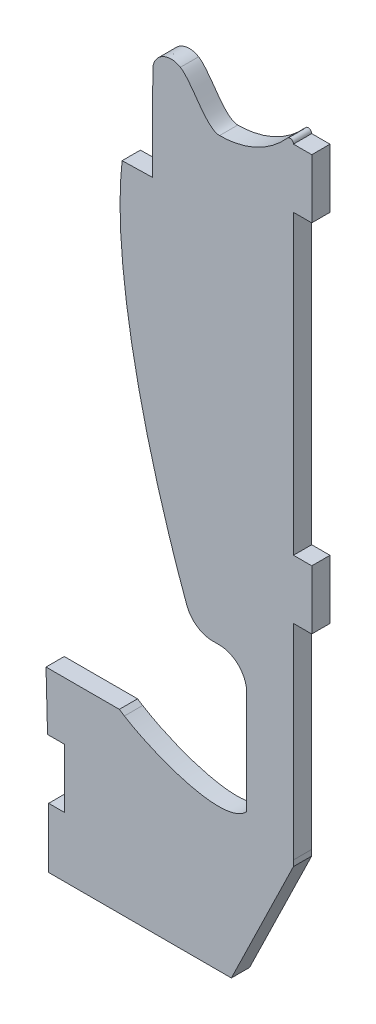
ISO-10303-21;
HEADER;
FILE_DESCRIPTION(('STEP AP214'),'2;1');
FILE_NAME('part.step','',(''),(''),'','','');
FILE_SCHEMA(('AUTOMOTIVE_DESIGN { 1 0 10303 214 1 1 1 1 }'));
ENDSEC;
DATA;
#1=APPLICATION_CONTEXT('core data for automotive mechanical design processes');
#2=APPLICATION_PROTOCOL_DEFINITION('international standard','automotive_design',2000,#1);
#3=PRODUCT_CONTEXT('',#1,'mechanical');
#4=PRODUCT('Part','Part','',(#3));
#5=PRODUCT_RELATED_PRODUCT_CATEGORY('part','',(#4));
#6=PRODUCT_DEFINITION_FORMATION('','',#4);
#7=PRODUCT_DEFINITION_CONTEXT('part definition',#1,'design');
#8=PRODUCT_DEFINITION('design','',#6,#7);
#9=PRODUCT_DEFINITION_SHAPE('','',#8);
#10=(LENGTH_UNIT() NAMED_UNIT(*) SI_UNIT(.MILLI.,.METRE.));
#11=(NAMED_UNIT(*) PLANE_ANGLE_UNIT() SI_UNIT($,.RADIAN.));
#12=(NAMED_UNIT(*) SI_UNIT($,.STERADIAN.) SOLID_ANGLE_UNIT());
#13=UNCERTAINTY_MEASURE_WITH_UNIT(LENGTH_MEASURE(1.E-05),#10,'distance_accuracy_value','');
#14=(GEOMETRIC_REPRESENTATION_CONTEXT(3) GLOBAL_UNCERTAINTY_ASSIGNED_CONTEXT((#13)) GLOBAL_UNIT_ASSIGNED_CONTEXT((#10,
#11,#12)) REPRESENTATION_CONTEXT('',''));
#15=CARTESIAN_POINT('',(0.,0.,0.));
#16=DIRECTION('',(0.,0.,1.));
#17=DIRECTION('',(1.,0.,0.));
#18=AXIS2_PLACEMENT_3D('',#15,#16,#17);
#19=CARTESIAN_POINT('',(669.415307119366,283.479999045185,3.));
#20=DIRECTION('',(0.,1.,0.));
#21=DIRECTION('',(0.,0.,1.));
#22=AXIS2_PLACEMENT_3D('',#19,#20,#21);
#23=PLANE('',#22);
#24=DIRECTION('',(1.,0.,0.));
#25=VECTOR('',#24,1.);
#26=CARTESIAN_POINT('',(669.415307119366,283.479999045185,0.));
#27=LINE('',#26,#25);
#28=CARTESIAN_POINT('',(666.406102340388,283.479999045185,0.));
#29=VERTEX_POINT('',#28);
#30=CARTESIAN_POINT('',(669.415307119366,283.479999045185,0.));
#31=VERTEX_POINT('',#30);
#32=EDGE_CURVE('E11',#29,#31,#27,.T.);
#33=ORIENTED_EDGE('',*,*,#32,.T.);
#34=DIRECTION('',(0.,0.,-1.));
#35=VECTOR('',#34,1.);
#36=CARTESIAN_POINT('',(669.415307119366,283.479999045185,3.));
#37=LINE('',#36,#35);
#38=CARTESIAN_POINT('',(669.415307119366,283.479999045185,3.));
#39=VERTEX_POINT('',#38);
#40=EDGE_CURVE('E277',#39,#31,#37,.T.);
#41=ORIENTED_EDGE('',*,*,#40,.F.);
#42=DIRECTION('',(1.,0.,0.));
#43=VECTOR('',#42,1.);
#44=CARTESIAN_POINT('',(669.415307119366,283.479999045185,3.));
#45=LINE('',#44,#43);
#46=CARTESIAN_POINT('',(666.406102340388,283.479999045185,3.));
#47=VERTEX_POINT('',#46);
#48=EDGE_CURVE('E166',#47,#39,#45,.T.);
#49=ORIENTED_EDGE('',*,*,#48,.F.);
#50=DIRECTION('',(0.,0.,-1.));
#51=VECTOR('',#50,1.);
#52=CARTESIAN_POINT('',(666.406102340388,283.479999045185,3.));
#53=LINE('',#52,#51);
#54=EDGE_CURVE('E726',#47,#29,#53,.T.);
#55=ORIENTED_EDGE('',*,*,#54,.T.);
#56=EDGE_LOOP('',(#33,#41,#49,#55));
#57=FACE_BOUND('',#56,.T.);
#58=ADVANCED_FACE('F44',(#57),#23,.F.);
#59=CARTESIAN_POINT('',(669.415307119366,293.199044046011,3.));
#60=DIRECTION('',(-1.,0.,0.));
#61=DIRECTION('',(0.,0.,1.));
#62=AXIS2_PLACEMENT_3D('',#59,#60,#61);
#63=PLANE('',#62);
#64=DIRECTION('',(0.,1.,0.));
#65=VECTOR('',#64,1.);
#66=CARTESIAN_POINT('',(669.415307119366,293.199044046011,0.));
#67=LINE('',#66,#65);
#68=CARTESIAN_POINT('',(669.415307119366,293.199044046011,0.));
#69=VERTEX_POINT('',#68);
#70=EDGE_CURVE('E57',#31,#69,#67,.T.);
#71=ORIENTED_EDGE('',*,*,#70,.T.);
#72=DIRECTION('',(0.,0.,-1.));
#73=VECTOR('',#72,1.);
#74=CARTESIAN_POINT('',(669.415307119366,293.199044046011,3.));
#75=LINE('',#74,#73);
#76=CARTESIAN_POINT('',(669.415307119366,293.199044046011,3.));
#77=VERTEX_POINT('',#76);
#78=EDGE_CURVE('E274',#77,#69,#75,.T.);
#79=ORIENTED_EDGE('',*,*,#78,.F.);
#80=DIRECTION('',(0.,1.,0.));
#81=VECTOR('',#80,1.);
#82=CARTESIAN_POINT('',(669.415307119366,293.199044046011,3.));
#83=LINE('',#82,#81);
#84=EDGE_CURVE('E466',#39,#77,#83,.T.);
#85=ORIENTED_EDGE('',*,*,#84,.F.);
#86=ORIENTED_EDGE('',*,*,#40,.T.);
#87=EDGE_LOOP('',(#71,#79,#85,#86));
#88=FACE_BOUND('',#87,.T.);
#89=ADVANCED_FACE('F275',(#88),#63,.F.);
#90=CARTESIAN_POINT('',(666.406102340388,293.199044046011,3.));
#91=DIRECTION('',(0.,-1.,0.));
#92=DIRECTION('',(0.,0.,-1.));
#93=AXIS2_PLACEMENT_3D('',#90,#91,#92);
#94=PLANE('',#93);
#95=DIRECTION('',(-1.,0.,0.));
#96=VECTOR('',#95,1.);
#97=CARTESIAN_POINT('',(666.406102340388,293.199044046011,0.));
#98=LINE('',#97,#96);
#99=CARTESIAN_POINT('',(666.406102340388,293.199044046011,0.));
#100=VERTEX_POINT('',#99);
#101=EDGE_CURVE('E284',#69,#100,#98,.T.);
#102=ORIENTED_EDGE('',*,*,#101,.T.);
#103=DIRECTION('',(0.,0.,-1.));
#104=VECTOR('',#103,1.);
#105=CARTESIAN_POINT('',(666.406102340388,293.199044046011,3.));
#106=LINE('',#105,#104);
#107=CARTESIAN_POINT('',(666.406102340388,293.199044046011,3.));
#108=VERTEX_POINT('',#107);
#109=EDGE_CURVE('E288',#108,#100,#106,.T.);
#110=ORIENTED_EDGE('',*,*,#109,.F.);
#111=DIRECTION('',(-1.,0.,0.));
#112=VECTOR('',#111,1.);
#113=CARTESIAN_POINT('',(666.406102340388,293.199044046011,3.));
#114=LINE('',#113,#112);
#115=EDGE_CURVE('E287',#77,#108,#114,.T.);
#116=ORIENTED_EDGE('',*,*,#115,.F.);
#117=ORIENTED_EDGE('',*,*,#78,.T.);
#118=EDGE_LOOP('',(#102,#110,#116,#117));
#119=FACE_BOUND('',#118,.T.);
#120=ADVANCED_FACE('F283',(#119),#94,.F.);
#121=CARTESIAN_POINT('',(666.406102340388,293.199044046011,3.));
#122=CARTESIAN_POINT('',(666.406102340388,293.720889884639,3.));
#123=CARTESIAN_POINT('',(665.762816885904,293.961443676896,3.));
#124=CARTESIAN_POINT('',(665.41710155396,293.570597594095,3.));
#125=B_SPLINE_CURVE_WITH_KNOTS('',3,(#121,#122,#123,#124),.UNSPECIFIED.,.F.,.F.,(4,4),(34.,35.),.UNSPECIFIED.);
#126=DIRECTION('',(0.,0.,-1.));
#127=VECTOR('',#126,1.);
#128=SURFACE_OF_LINEAR_EXTRUSION('',#125,#127);
#129=CARTESIAN_POINT('',(666.406102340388,293.199044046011,0.));
#130=CARTESIAN_POINT('',(666.406102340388,293.720889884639,0.));
#131=CARTESIAN_POINT('',(665.762816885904,293.961443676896,0.));
#132=CARTESIAN_POINT('',(665.41710155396,293.570597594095,0.));
#133=B_SPLINE_CURVE_WITH_KNOTS('',3,(#129,#130,#131,#132),.UNSPECIFIED.,.F.,.F.,(4,4),(34.,35.),.UNSPECIFIED.);
#134=CARTESIAN_POINT('',(665.41710155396,293.570597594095,0.));
#135=VERTEX_POINT('',#134);
#136=EDGE_CURVE('E295',#100,#135,#133,.T.);
#137=ORIENTED_EDGE('',*,*,#136,.T.);
#138=DIRECTION('',(0.,0.,-1.));
#139=VECTOR('',#138,1.);
#140=CARTESIAN_POINT('',(665.41710155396,293.570597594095,3.));
#141=LINE('',#140,#139);
#142=CARTESIAN_POINT('',(665.41710155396,293.570597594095,3.));
#143=VERTEX_POINT('',#142);
#144=EDGE_CURVE('E605',#143,#135,#141,.T.);
#145=ORIENTED_EDGE('',*,*,#144,.F.);
#146=EDGE_CURVE('E455',#108,#143,#125,.T.);
#147=ORIENTED_EDGE('',*,*,#146,.F.);
#148=ORIENTED_EDGE('',*,*,#109,.T.);
#149=EDGE_LOOP('',(#137,#145,#147,#148));
#150=FACE_BOUND('',#149,.T.);
#151=ADVANCED_FACE('F443',(#150),#128,.F.);
#152=CARTESIAN_POINT('',(665.41710155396,293.570597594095,3.));
#153=CARTESIAN_POINT('',(662.558791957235,290.339787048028,3.));
#154=CARTESIAN_POINT('',(658.606836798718,288.341287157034,3.));
#155=CARTESIAN_POINT('',(654.242331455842,288.341287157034,3.));
#156=B_SPLINE_CURVE_WITH_KNOTS('',3,(#152,#153,#154,#155),.UNSPECIFIED.,.F.,.F.,(4,4),(33.,34.),.UNSPECIFIED.);
#157=DIRECTION('',(0.,0.,-1.));
#158=VECTOR('',#157,1.);
#159=SURFACE_OF_LINEAR_EXTRUSION('',#156,#158);
#160=CARTESIAN_POINT('',(665.41710155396,293.570597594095,0.));
#161=CARTESIAN_POINT('',(662.558791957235,290.339787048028,0.));
#162=CARTESIAN_POINT('',(658.606836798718,288.341287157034,0.));
#163=CARTESIAN_POINT('',(654.242331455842,288.341287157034,0.));
#164=B_SPLINE_CURVE_WITH_KNOTS('',3,(#160,#161,#162,#163),.UNSPECIFIED.,.F.,.F.,(4,4),(33.,34.),.UNSPECIFIED.);
#165=CARTESIAN_POINT('',(654.242331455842,288.341287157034,0.));
#166=VERTEX_POINT('',#165);
#167=EDGE_CURVE('E296',#135,#166,#164,.T.);
#168=ORIENTED_EDGE('',*,*,#167,.T.);
#169=DIRECTION('',(0.,0.,-1.));
#170=VECTOR('',#169,1.);
#171=CARTESIAN_POINT('',(654.242331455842,288.341287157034,3.));
#172=LINE('',#171,#170);
#173=CARTESIAN_POINT('',(654.242331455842,288.341287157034,3.));
#174=VERTEX_POINT('',#173);
#175=EDGE_CURVE('E599',#174,#166,#172,.T.);
#176=ORIENTED_EDGE('',*,*,#175,.F.);
#177=EDGE_CURVE('E460',#143,#174,#156,.T.);
#178=ORIENTED_EDGE('',*,*,#177,.F.);
#179=ORIENTED_EDGE('',*,*,#144,.T.);
#180=EDGE_LOOP('',(#168,#176,#178,#179));
#181=FACE_BOUND('',#180,.T.);
#182=ADVANCED_FACE('F449',(#181),#159,.F.);
#183=CARTESIAN_POINT('',(654.242331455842,288.341287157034,3.));
#184=CARTESIAN_POINT('',(651.943936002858,288.341287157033,3.));
#185=CARTESIAN_POINT('',(649.759917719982,293.654830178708,3.));
#186=CARTESIAN_POINT('',(647.789667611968,294.841234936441,3.));
#187=B_SPLINE_CURVE_WITH_KNOTS('',3,(#183,#184,#185,#186),.UNSPECIFIED.,.F.,.F.,(4,4),(32.,33.),.UNSPECIFIED.);
#188=DIRECTION('',(0.,0.,-1.));
#189=VECTOR('',#188,1.);
#190=SURFACE_OF_LINEAR_EXTRUSION('',#187,#189);
#191=CARTESIAN_POINT('',(654.242331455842,288.341287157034,0.));
#192=CARTESIAN_POINT('',(651.943936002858,288.341287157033,0.));
#193=CARTESIAN_POINT('',(649.759917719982,293.654830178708,0.));
#194=CARTESIAN_POINT('',(647.789667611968,294.841234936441,0.));
#195=B_SPLINE_CURVE_WITH_KNOTS('',3,(#191,#192,#193,#194),.UNSPECIFIED.,.F.,.F.,(4,4),(32.,33.),.UNSPECIFIED.);
#196=CARTESIAN_POINT('',(647.78966761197,294.841234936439,0.));
#197=VERTEX_POINT('',#196);
#198=EDGE_CURVE('E579',#166,#197,#195,.T.);
#199=ORIENTED_EDGE('',*,*,#198,.T.);
#200=DIRECTION('',(0.,0.,-1.));
#201=VECTOR('',#200,1.);
#202=CARTESIAN_POINT('',(647.78966761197,294.841234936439,3.));
#203=LINE('',#202,#201);
#204=CARTESIAN_POINT('',(647.78966761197,294.841234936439,3.));
#205=VERTEX_POINT('',#204);
#206=EDGE_CURVE('E607',#205,#197,#203,.T.);
#207=ORIENTED_EDGE('',*,*,#206,.F.);
#208=EDGE_CURVE('E610',#174,#205,#187,.T.);
#209=ORIENTED_EDGE('',*,*,#208,.F.);
#210=ORIENTED_EDGE('',*,*,#175,.T.);
#211=EDGE_LOOP('',(#199,#207,#209,#210));
#212=FACE_BOUND('',#211,.T.);
#213=ADVANCED_FACE('F603',(#212),#190,.F.);
#214=CARTESIAN_POINT('',(647.78966761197,294.841234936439,3.));
#215=CARTESIAN_POINT('',(645.79978045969,296.039525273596,3.));
#216=CARTESIAN_POINT('',(643.262812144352,294.580957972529,3.));
#217=CARTESIAN_POINT('',(643.249893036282,292.258102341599,3.));
#218=B_SPLINE_CURVE_WITH_KNOTS('',3,(#214,#215,#216,#217),.UNSPECIFIED.,.F.,.F.,(4,4),(31.,32.),.UNSPECIFIED.);
#219=DIRECTION('',(0.,0.,-1.));
#220=VECTOR('',#219,1.);
#221=SURFACE_OF_LINEAR_EXTRUSION('',#218,#220);
#222=CARTESIAN_POINT('',(647.78966761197,294.841234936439,0.));
#223=CARTESIAN_POINT('',(645.79978045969,296.039525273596,0.));
#224=CARTESIAN_POINT('',(643.262812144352,294.580957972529,0.));
#225=CARTESIAN_POINT('',(643.249893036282,292.258102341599,0.));
#226=B_SPLINE_CURVE_WITH_KNOTS('',3,(#222,#223,#224,#225),.UNSPECIFIED.,.F.,.F.,(4,4),(31.,32.),.UNSPECIFIED.);
#227=CARTESIAN_POINT('',(643.249893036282,292.258102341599,0.));
#228=VERTEX_POINT('',#227);
#229=EDGE_CURVE('E572',#197,#228,#226,.T.);
#230=ORIENTED_EDGE('',*,*,#229,.T.);
#231=DIRECTION('',(0.,0.,-1.));
#232=VECTOR('',#231,1.);
#233=CARTESIAN_POINT('',(643.249893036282,292.258102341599,3.));
#234=LINE('',#233,#232);
#235=CARTESIAN_POINT('',(643.249893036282,292.258102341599,3.));
#236=VERTEX_POINT('',#235);
#237=EDGE_CURVE('E619',#236,#228,#234,.T.);
#238=ORIENTED_EDGE('',*,*,#237,.F.);
#239=EDGE_CURVE('E737',#205,#236,#218,.T.);
#240=ORIENTED_EDGE('',*,*,#239,.F.);
#241=ORIENTED_EDGE('',*,*,#206,.T.);
#242=EDGE_LOOP('',(#230,#238,#240,#241));
#243=FACE_BOUND('',#242,.T.);
#244=ADVANCED_FACE('F616',(#243),#221,.F.);
#245=CARTESIAN_POINT('',(643.212944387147,282.796750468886,3.));
#246=DIRECTION('',(0.99999237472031,-0.00390518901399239,0.));
#247=DIRECTION('',(0.0039051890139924,0.99999237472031,0.));
#248=AXIS2_PLACEMENT_3D('',#245,#246,#247);
#249=PLANE('',#248);
#250=DIRECTION('',(-0.00390518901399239,-0.99999237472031,0.));
#251=VECTOR('',#250,1.);
#252=CARTESIAN_POINT('',(643.212944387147,282.796750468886,0.));
#253=LINE('',#252,#251);
#254=CARTESIAN_POINT('',(643.212944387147,282.796750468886,0.));
#255=VERTEX_POINT('',#254);
#256=EDGE_CURVE('E569',#228,#255,#253,.T.);
#257=ORIENTED_EDGE('',*,*,#256,.T.);
#258=DIRECTION('',(0.,0.,-1.));
#259=VECTOR('',#258,1.);
#260=CARTESIAN_POINT('',(643.212944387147,282.796750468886,3.));
#261=LINE('',#260,#259);
#262=CARTESIAN_POINT('',(643.212944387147,282.796750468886,3.));
#263=VERTEX_POINT('',#262);
#264=EDGE_CURVE('E628',#263,#255,#261,.T.);
#265=ORIENTED_EDGE('',*,*,#264,.F.);
#266=DIRECTION('',(-0.00390518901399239,-0.99999237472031,0.));
#267=VECTOR('',#266,1.);
#268=CARTESIAN_POINT('',(643.212944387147,282.796750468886,3.));
#269=LINE('',#268,#267);
#270=EDGE_CURVE('E626',#236,#263,#269,.T.);
#271=ORIENTED_EDGE('',*,*,#270,.F.);
#272=ORIENTED_EDGE('',*,*,#237,.T.);
#273=EDGE_LOOP('',(#257,#265,#271,#272));
#274=FACE_BOUND('',#273,.T.);
#275=ADVANCED_FACE('F621',(#274),#249,.F.);
#276=CARTESIAN_POINT('',(643.211566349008,282.437685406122,3.));
#277=DIRECTION('',(0.999992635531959,-0.00383782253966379,0.));
#278=DIRECTION('',(0.00383782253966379,0.999992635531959,0.));
#279=AXIS2_PLACEMENT_3D('',#276,#277,#278);
#280=PLANE('',#279);
#281=DIRECTION('',(-0.00383782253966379,-0.999992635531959,0.));
#282=VECTOR('',#281,1.);
#283=CARTESIAN_POINT('',(643.211566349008,282.437685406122,0.));
#284=LINE('',#283,#282);
#285=CARTESIAN_POINT('',(643.211566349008,282.437685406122,0.));
#286=VERTEX_POINT('',#285);
#287=EDGE_CURVE('E570',#255,#286,#284,.T.);
#288=ORIENTED_EDGE('',*,*,#287,.T.);
#289=DIRECTION('',(0.,0.,-1.));
#290=VECTOR('',#289,1.);
#291=CARTESIAN_POINT('',(643.211566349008,282.437685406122,3.));
#292=LINE('',#291,#290);
#293=CARTESIAN_POINT('',(643.211566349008,282.437685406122,3.));
#294=VERTEX_POINT('',#293);
#295=EDGE_CURVE('E635',#294,#286,#292,.T.);
#296=ORIENTED_EDGE('',*,*,#295,.F.);
#297=DIRECTION('',(-0.00383782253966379,-0.999992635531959,0.));
#298=VECTOR('',#297,1.);
#299=CARTESIAN_POINT('',(643.211566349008,282.437685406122,3.));
#300=LINE('',#299,#298);
#301=EDGE_CURVE('E796',#263,#294,#300,.T.);
#302=ORIENTED_EDGE('',*,*,#301,.F.);
#303=ORIENTED_EDGE('',*,*,#264,.T.);
#304=EDGE_LOOP('',(#288,#296,#302,#303));
#305=FACE_BOUND('',#304,.T.);
#306=ADVANCED_FACE('F757',(#305),#280,.F.);
#307=CARTESIAN_POINT('',(643.189776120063,276.854822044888,3.));
#308=DIRECTION('',(0.999992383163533,-0.00390302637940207,0.));
#309=DIRECTION('',(0.00390302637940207,0.999992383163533,0.));
#310=AXIS2_PLACEMENT_3D('',#307,#308,#309);
#311=PLANE('',#310);
#312=DIRECTION('',(-0.00390302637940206,-0.999992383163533,0.));
#313=VECTOR('',#312,1.);
#314=CARTESIAN_POINT('',(643.189776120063,276.854822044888,0.));
#315=LINE('',#314,#313);
#316=CARTESIAN_POINT('',(643.189776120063,276.854822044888,0.));
#317=VERTEX_POINT('',#316);
#318=EDGE_CURVE('E562',#286,#317,#315,.T.);
#319=ORIENTED_EDGE('',*,*,#318,.T.);
#320=DIRECTION('',(0.,0.,-1.));
#321=VECTOR('',#320,1.);
#322=CARTESIAN_POINT('',(643.189776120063,276.854822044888,3.));
#323=LINE('',#322,#321);
#324=CARTESIAN_POINT('',(643.189776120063,276.854822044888,3.));
#325=VERTEX_POINT('',#324);
#326=EDGE_CURVE('E638',#325,#317,#323,.T.);
#327=ORIENTED_EDGE('',*,*,#326,.F.);
#328=DIRECTION('',(-0.00390302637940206,-0.999992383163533,0.));
#329=VECTOR('',#328,1.);
#330=CARTESIAN_POINT('',(643.189776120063,276.854822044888,3.));
#331=LINE('',#330,#329);
#332=EDGE_CURVE('E797',#294,#325,#331,.T.);
#333=ORIENTED_EDGE('',*,*,#332,.F.);
#334=ORIENTED_EDGE('',*,*,#295,.T.);
#335=EDGE_LOOP('',(#319,#327,#333,#334));
#336=FACE_BOUND('',#335,.T.);
#337=ADVANCED_FACE('F765',(#336),#311,.F.);
#338=CARTESIAN_POINT('',(638.198005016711,276.741909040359,3.));
#339=DIRECTION('',(0.0226140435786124,-0.999744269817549,0.));
#340=DIRECTION('',(0.999744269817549,0.0226140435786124,0.));
#341=AXIS2_PLACEMENT_3D('',#338,#339,#340);
#342=PLANE('',#341);
#343=DIRECTION('',(-0.999744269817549,-0.0226140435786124,0.));
#344=VECTOR('',#343,1.);
#345=CARTESIAN_POINT('',(638.198005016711,276.741909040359,0.));
#346=LINE('',#345,#344);
#347=CARTESIAN_POINT('',(638.198005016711,276.741909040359,0.));
#348=VERTEX_POINT('',#347);
#349=EDGE_CURVE('E556',#317,#348,#346,.T.);
#350=ORIENTED_EDGE('',*,*,#349,.T.);
#351=DIRECTION('',(0.,0.,-1.));
#352=VECTOR('',#351,1.);
#353=CARTESIAN_POINT('',(638.198005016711,276.741909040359,3.));
#354=LINE('',#353,#352);
#355=CARTESIAN_POINT('',(638.198005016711,276.741909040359,3.));
#356=VERTEX_POINT('',#355);
#357=EDGE_CURVE('E644',#356,#348,#354,.T.);
#358=ORIENTED_EDGE('',*,*,#357,.F.);
#359=DIRECTION('',(-0.999744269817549,-0.0226140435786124,0.));
#360=VECTOR('',#359,1.);
#361=CARTESIAN_POINT('',(638.198005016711,276.741909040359,3.));
#362=LINE('',#361,#360);
#363=EDGE_CURVE('E782',#325,#356,#362,.T.);
#364=ORIENTED_EDGE('',*,*,#363,.F.);
#365=ORIENTED_EDGE('',*,*,#326,.T.);
#366=EDGE_LOOP('',(#350,#358,#364,#365));
#367=FACE_BOUND('',#366,.T.);
#368=ADVANCED_FACE('F766',(#367),#342,.F.);
#369=CARTESIAN_POINT('',(638.198005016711,276.741909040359,3.));
#370=CARTESIAN_POINT('',(636.555986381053,262.673258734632,3.));
#371=CARTESIAN_POINT('',(641.007049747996,240.081183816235,3.));
#372=CARTESIAN_POINT('',(648.840077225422,218.714443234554,3.));
#373=B_SPLINE_CURVE_WITH_KNOTS('',3,(#369,#370,#371,#372),.UNSPECIFIED.,.F.,.F.,(4,4),(26.,27.),.UNSPECIFIED.);
#374=DIRECTION('',(0.,0.,-1.));
#375=VECTOR('',#374,1.);
#376=SURFACE_OF_LINEAR_EXTRUSION('',#373,#375);
#377=CARTESIAN_POINT('',(638.198005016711,276.741909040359,0.));
#378=CARTESIAN_POINT('',(636.555986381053,262.673258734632,0.));
#379=CARTESIAN_POINT('',(641.007049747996,240.081183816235,0.));
#380=CARTESIAN_POINT('',(648.840077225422,218.714443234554,0.));
#381=B_SPLINE_CURVE_WITH_KNOTS('',3,(#377,#378,#379,#380),.UNSPECIFIED.,.F.,.F.,(4,4),(26.,27.),.UNSPECIFIED.);
#382=CARTESIAN_POINT('',(648.840077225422,218.714443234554,0.));
#383=VERTEX_POINT('',#382);
#384=EDGE_CURVE('E550',#348,#383,#381,.T.);
#385=ORIENTED_EDGE('',*,*,#384,.T.);
#386=DIRECTION('',(0.,0.,-1.));
#387=VECTOR('',#386,1.);
#388=CARTESIAN_POINT('',(648.840077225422,218.714443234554,3.));
#389=LINE('',#388,#387);
#390=CARTESIAN_POINT('',(648.840077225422,218.714443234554,3.));
#391=VERTEX_POINT('',#390);
#392=EDGE_CURVE('E650',#391,#383,#389,.T.);
#393=ORIENTED_EDGE('',*,*,#392,.F.);
#394=EDGE_CURVE('E776',#356,#391,#373,.T.);
#395=ORIENTED_EDGE('',*,*,#394,.F.);
#396=ORIENTED_EDGE('',*,*,#357,.T.);
#397=EDGE_LOOP('',(#385,#393,#395,#396));
#398=FACE_BOUND('',#397,.T.);
#399=ADVANCED_FACE('F769',(#398),#376,.F.);
#400=CARTESIAN_POINT('',(648.840077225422,218.714443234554,3.));
#401=CARTESIAN_POINT('',(649.487841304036,216.94771214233,3.));
#402=CARTESIAN_POINT('',(651.151477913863,215.756914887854,3.));
#403=CARTESIAN_POINT('',(653.032758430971,215.71410957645,3.));
#404=B_SPLINE_CURVE_WITH_KNOTS('',3,(#400,#401,#402,#403),.UNSPECIFIED.,.F.,.F.,(4,4),(25.,26.),.UNSPECIFIED.);
#405=DIRECTION('',(0.,0.,-1.));
#406=VECTOR('',#405,1.);
#407=SURFACE_OF_LINEAR_EXTRUSION('',#404,#406);
#408=CARTESIAN_POINT('',(648.840077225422,218.714443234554,0.));
#409=CARTESIAN_POINT('',(649.487841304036,216.94771214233,0.));
#410=CARTESIAN_POINT('',(651.151477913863,215.756914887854,0.));
#411=CARTESIAN_POINT('',(653.032758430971,215.71410957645,0.));
#412=B_SPLINE_CURVE_WITH_KNOTS('',3,(#408,#409,#410,#411),.UNSPECIFIED.,.F.,.F.,(4,4),(25.,26.),.UNSPECIFIED.);
#413=CARTESIAN_POINT('',(653.032758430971,215.71410957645,0.));
#414=VERTEX_POINT('',#413);
#415=EDGE_CURVE('E542',#383,#414,#412,.T.);
#416=ORIENTED_EDGE('',*,*,#415,.T.);
#417=DIRECTION('',(0.,0.,-1.));
#418=VECTOR('',#417,1.);
#419=CARTESIAN_POINT('',(653.032758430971,215.71410957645,3.));
#420=LINE('',#419,#418);
#421=CARTESIAN_POINT('',(653.032758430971,215.71410957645,3.));
#422=VERTEX_POINT('',#421);
#423=EDGE_CURVE('E654',#422,#414,#420,.T.);
#424=ORIENTED_EDGE('',*,*,#423,.F.);
#425=EDGE_CURVE('E786',#391,#422,#404,.T.);
#426=ORIENTED_EDGE('',*,*,#425,.F.);
#427=ORIENTED_EDGE('',*,*,#392,.T.);
#428=EDGE_LOOP('',(#416,#424,#426,#427));
#429=FACE_BOUND('',#428,.T.);
#430=ADVANCED_FACE('F773',(#429),#407,.F.);
#431=CARTESIAN_POINT('',(654.140701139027,215.71410957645,3.));
#432=DIRECTION('',(0.,1.,0.));
#433=DIRECTION('',(0.,0.,1.));
#434=AXIS2_PLACEMENT_3D('',#431,#432,#433);
#435=PLANE('',#434);
#436=DIRECTION('',(1.,0.,0.));
#437=VECTOR('',#436,1.);
#438=CARTESIAN_POINT('',(654.140701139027,215.71410957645,0.));
#439=LINE('',#438,#437);
#440=CARTESIAN_POINT('',(654.140701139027,215.71410957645,0.));
#441=VERTEX_POINT('',#440);
#442=EDGE_CURVE('E536',#414,#441,#439,.T.);
#443=ORIENTED_EDGE('',*,*,#442,.T.);
#444=DIRECTION('',(0.,0.,-1.));
#445=VECTOR('',#444,1.);
#446=CARTESIAN_POINT('',(654.140701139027,215.71410957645,3.));
#447=LINE('',#446,#445);
#448=CARTESIAN_POINT('',(654.140701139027,215.71410957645,3.));
#449=VERTEX_POINT('',#448);
#450=EDGE_CURVE('E652',#449,#441,#447,.T.);
#451=ORIENTED_EDGE('',*,*,#450,.F.);
#452=DIRECTION('',(1.,0.,0.));
#453=VECTOR('',#452,1.);
#454=CARTESIAN_POINT('',(654.140701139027,215.71410957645,3.));
#455=LINE('',#454,#453);
#456=EDGE_CURVE('E819',#422,#449,#455,.T.);
#457=ORIENTED_EDGE('',*,*,#456,.F.);
#458=ORIENTED_EDGE('',*,*,#423,.T.);
#459=EDGE_LOOP('',(#443,#451,#457,#458));
#460=FACE_BOUND('',#459,.T.);
#461=ADVANCED_FACE('F835',(#460),#435,.F.);
#462=CARTESIAN_POINT('',(654.140701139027,215.71410957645,3.));
#463=CARTESIAN_POINT('',(656.665697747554,215.71410957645,3.));
#464=CARTESIAN_POINT('',(658.712601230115,213.667206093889,3.));
#465=CARTESIAN_POINT('',(658.712601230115,211.142123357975,3.));
#466=B_SPLINE_CURVE_WITH_KNOTS('',3,(#462,#463,#464,#465),.UNSPECIFIED.,.F.,.F.,(4,4),(23.,24.),.UNSPECIFIED.);
#467=DIRECTION('',(0.,0.,-1.));
#468=VECTOR('',#467,1.);
#469=SURFACE_OF_LINEAR_EXTRUSION('',#466,#468);
#470=CARTESIAN_POINT('',(654.140701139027,215.71410957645,0.));
#471=CARTESIAN_POINT('',(656.665697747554,215.71410957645,0.));
#472=CARTESIAN_POINT('',(658.712601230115,213.667206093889,0.));
#473=CARTESIAN_POINT('',(658.712601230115,211.142123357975,0.));
#474=B_SPLINE_CURVE_WITH_KNOTS('',3,(#470,#471,#472,#473),.UNSPECIFIED.,.F.,.F.,(4,4),(23.,24.),.UNSPECIFIED.);
#475=CARTESIAN_POINT('',(658.712601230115,211.142123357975,0.));
#476=VERTEX_POINT('',#475);
#477=EDGE_CURVE('E531',#441,#476,#474,.T.);
#478=ORIENTED_EDGE('',*,*,#477,.T.);
#479=DIRECTION('',(0.,0.,-1.));
#480=VECTOR('',#479,1.);
#481=CARTESIAN_POINT('',(658.712601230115,211.142123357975,3.));
#482=LINE('',#481,#480);
#483=CARTESIAN_POINT('',(658.712601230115,211.142123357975,3.));
#484=VERTEX_POINT('',#483);
#485=EDGE_CURVE('E658',#484,#476,#482,.T.);
#486=ORIENTED_EDGE('',*,*,#485,.F.);
#487=EDGE_CURVE('E821',#449,#484,#466,.T.);
#488=ORIENTED_EDGE('',*,*,#487,.F.);
#489=ORIENTED_EDGE('',*,*,#450,.T.);
#490=EDGE_LOOP('',(#478,#486,#488,#489));
#491=FACE_BOUND('',#490,.T.);
#492=ADVANCED_FACE('F829',(#491),#469,.F.);
#493=CARTESIAN_POINT('',(658.712601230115,194.191047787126,3.));
#494=DIRECTION('',(1.,0.,0.));
#495=DIRECTION('',(0.,0.,-1.));
#496=AXIS2_PLACEMENT_3D('',#493,#494,#495);
#497=PLANE('',#496);
#498=DIRECTION('',(0.,-1.,0.));
#499=VECTOR('',#498,1.);
#500=CARTESIAN_POINT('',(658.712601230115,194.191047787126,0.));
#501=LINE('',#500,#499);
#502=CARTESIAN_POINT('',(658.712601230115,194.191047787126,0.));
#503=VERTEX_POINT('',#502);
#504=EDGE_CURVE('E527',#476,#503,#501,.T.);
#505=ORIENTED_EDGE('',*,*,#504,.T.);
#506=DIRECTION('',(0.,0.,-1.));
#507=VECTOR('',#506,1.);
#508=CARTESIAN_POINT('',(658.712601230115,194.191047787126,3.));
#509=LINE('',#508,#507);
#510=CARTESIAN_POINT('',(658.712601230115,194.191047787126,3.));
#511=VERTEX_POINT('',#510);
#512=EDGE_CURVE('E661',#511,#503,#509,.T.);
#513=ORIENTED_EDGE('',*,*,#512,.F.);
#514=DIRECTION('',(0.,-1.,0.));
#515=VECTOR('',#514,1.);
#516=CARTESIAN_POINT('',(658.712601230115,203.048646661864,3.));
#517=LINE('',#516,#515);
#518=EDGE_CURVE('E358',#484,#511,#517,.T.);
#519=ORIENTED_EDGE('',*,*,#518,.F.);
#520=ORIENTED_EDGE('',*,*,#485,.T.);
#521=EDGE_LOOP('',(#505,#513,#519,#520));
#522=FACE_BOUND('',#521,.T.);
#523=ADVANCED_FACE('F370',(#522),#497,.F.);
#524=CARTESIAN_POINT('',(658.712601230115,194.191047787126,3.));
#525=CARTESIAN_POINT('',(654.95572460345,190.173119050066,3.));
#526=CARTESIAN_POINT('',(643.229394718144,194.827443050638,3.));
#527=CARTESIAN_POINT('',(638.578688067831,197.764731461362,3.));
#528=B_SPLINE_CURVE_WITH_KNOTS('',3,(#524,#525,#526,#527),.UNSPECIFIED.,.F.,.F.,(4,4),(18.,19.),.UNSPECIFIED.);
#529=DIRECTION('',(0.,0.,-1.));
#530=VECTOR('',#529,1.);
#531=SURFACE_OF_LINEAR_EXTRUSION('',#528,#530);
#532=CARTESIAN_POINT('',(658.712601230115,194.191047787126,0.));
#533=CARTESIAN_POINT('',(654.95572460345,190.173119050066,0.));
#534=CARTESIAN_POINT('',(643.229394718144,194.827443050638,0.));
#535=CARTESIAN_POINT('',(638.578688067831,197.764731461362,0.));
#536=B_SPLINE_CURVE_WITH_KNOTS('',3,(#532,#533,#534,#535),.UNSPECIFIED.,.F.,.F.,(4,4),(18.,19.),.UNSPECIFIED.);
#537=CARTESIAN_POINT('',(638.578688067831,197.764731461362,0.));
#538=VERTEX_POINT('',#537);
#539=EDGE_CURVE('E521',#503,#538,#536,.T.);
#540=ORIENTED_EDGE('',*,*,#539,.T.);
#541=DIRECTION('',(0.,0.,-1.));
#542=VECTOR('',#541,1.);
#543=CARTESIAN_POINT('',(638.578688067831,197.764731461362,3.));
#544=LINE('',#543,#542);
#545=CARTESIAN_POINT('',(638.578688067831,197.764731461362,3.));
#546=VERTEX_POINT('',#545);
#547=EDGE_CURVE('E670',#546,#538,#544,.T.);
#548=ORIENTED_EDGE('',*,*,#547,.F.);
#549=EDGE_CURVE('E347',#511,#546,#528,.T.);
#550=ORIENTED_EDGE('',*,*,#549,.F.);
#551=ORIENTED_EDGE('',*,*,#512,.T.);
#552=EDGE_LOOP('',(#540,#548,#550,#551));
#553=FACE_BOUND('',#552,.T.);
#554=ADVANCED_FACE('F365',(#553),#531,.F.);
#555=CARTESIAN_POINT('',(637.739462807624,198.294759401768,3.));
#556=DIRECTION('',(-0.533986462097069,-0.845493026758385,0.));
#557=DIRECTION('',(0.845493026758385,-0.53398646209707,0.));
#558=AXIS2_PLACEMENT_3D('',#555,#556,#557);
#559=PLANE('',#558);
#560=DIRECTION('',(-0.845493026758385,0.53398646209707,0.));
#561=VECTOR('',#560,1.);
#562=CARTESIAN_POINT('',(637.739462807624,198.294759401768,0.));
#563=LINE('',#562,#561);
#564=CARTESIAN_POINT('',(637.739462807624,198.294759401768,0.));
#565=VERTEX_POINT('',#564);
#566=EDGE_CURVE('E516',#538,#565,#563,.T.);
#567=ORIENTED_EDGE('',*,*,#566,.T.);
#568=DIRECTION('',(0.,0.,-1.));
#569=VECTOR('',#568,1.);
#570=CARTESIAN_POINT('',(637.739462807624,198.294759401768,3.));
#571=LINE('',#570,#569);
#572=CARTESIAN_POINT('',(637.739462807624,198.294759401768,3.));
#573=VERTEX_POINT('',#572);
#574=EDGE_CURVE('E674',#573,#565,#571,.T.);
#575=ORIENTED_EDGE('',*,*,#574,.F.);
#576=DIRECTION('',(-0.845493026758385,0.53398646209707,0.));
#577=VECTOR('',#576,1.);
#578=CARTESIAN_POINT('',(637.739462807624,198.294759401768,3.));
#579=LINE('',#578,#577);
#580=EDGE_CURVE('E346',#546,#573,#579,.T.);
#581=ORIENTED_EDGE('',*,*,#580,.F.);
#582=ORIENTED_EDGE('',*,*,#547,.T.);
#583=EDGE_LOOP('',(#567,#575,#581,#582));
#584=FACE_BOUND('',#583,.T.);
#585=ADVANCED_FACE('F366',(#584),#559,.F.);
#586=CARTESIAN_POINT('',(625.671465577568,198.294759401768,3.));
#587=DIRECTION('',(0.,-1.,0.));
#588=DIRECTION('',(0.,0.,-1.));
#589=AXIS2_PLACEMENT_3D('',#586,#587,#588);
#590=PLANE('',#589);
#591=DIRECTION('',(-1.,0.,0.));
#592=VECTOR('',#591,1.);
#593=CARTESIAN_POINT('',(625.671465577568,198.294759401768,0.));
#594=LINE('',#593,#592);
#595=CARTESIAN_POINT('',(625.671465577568,198.294759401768,0.));
#596=VERTEX_POINT('',#595);
#597=EDGE_CURVE('E517',#565,#596,#594,.T.);
#598=ORIENTED_EDGE('',*,*,#597,.T.);
#599=DIRECTION('',(0.,0.,-1.));
#600=VECTOR('',#599,1.);
#601=CARTESIAN_POINT('',(625.671465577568,198.294759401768,3.));
#602=LINE('',#601,#600);
#603=CARTESIAN_POINT('',(625.671465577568,198.294759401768,3.));
#604=VERTEX_POINT('',#603);
#605=EDGE_CURVE('E672',#604,#596,#602,.T.);
#606=ORIENTED_EDGE('',*,*,#605,.F.);
#607=DIRECTION('',(-1.,0.,0.));
#608=VECTOR('',#607,1.);
#609=CARTESIAN_POINT('',(625.671465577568,198.294759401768,3.));
#610=LINE('',#609,#608);
#611=EDGE_CURVE('E341',#573,#604,#610,.T.);
#612=ORIENTED_EDGE('',*,*,#611,.F.);
#613=ORIENTED_EDGE('',*,*,#574,.T.);
#614=EDGE_LOOP('',(#598,#606,#612,#613));
#615=FACE_BOUND('',#614,.T.);
#616=ADVANCED_FACE('F375',(#615),#590,.F.);
#617=CARTESIAN_POINT('',(625.924077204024,188.800679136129,3.));
#618=DIRECTION('',(0.999646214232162,0.0265978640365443,0.));
#619=DIRECTION('',(-0.0265978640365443,0.999646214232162,0.));
#620=AXIS2_PLACEMENT_3D('',#617,#618,#619);
#621=PLANE('',#620);
#622=DIRECTION('',(0.0265978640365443,-0.999646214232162,0.));
#623=VECTOR('',#622,1.);
#624=CARTESIAN_POINT('',(625.924077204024,188.800679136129,0.));
#625=LINE('',#624,#623);
#626=CARTESIAN_POINT('',(625.924077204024,188.800679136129,0.));
#627=VERTEX_POINT('',#626);
#628=EDGE_CURVE('E514',#596,#627,#625,.T.);
#629=ORIENTED_EDGE('',*,*,#628,.T.);
#630=DIRECTION('',(0.,0.,-1.));
#631=VECTOR('',#630,1.);
#632=CARTESIAN_POINT('',(625.924077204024,188.800679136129,3.));
#633=LINE('',#632,#631);
#634=CARTESIAN_POINT('',(625.924077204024,188.800679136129,3.));
#635=VERTEX_POINT('',#634);
#636=EDGE_CURVE('E678',#635,#627,#633,.T.);
#637=ORIENTED_EDGE('',*,*,#636,.F.);
#638=DIRECTION('',(0.0265978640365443,-0.999646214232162,0.));
#639=VECTOR('',#638,1.);
#640=CARTESIAN_POINT('',(625.924077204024,188.800679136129,3.));
#641=LINE('',#640,#639);
#642=EDGE_CURVE('E342',#604,#635,#641,.T.);
#643=ORIENTED_EDGE('',*,*,#642,.F.);
#644=ORIENTED_EDGE('',*,*,#605,.T.);
#645=EDGE_LOOP('',(#629,#637,#643,#644));
#646=FACE_BOUND('',#645,.T.);
#647=ADVANCED_FACE('F376',(#646),#621,.F.);
#648=CARTESIAN_POINT('',(628.679981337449,188.800679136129,3.));
#649=DIRECTION('',(0.,1.,0.));
#650=DIRECTION('',(0.,0.,1.));
#651=AXIS2_PLACEMENT_3D('',#648,#649,#650);
#652=PLANE('',#651);
#653=DIRECTION('',(1.,0.,0.));
#654=VECTOR('',#653,1.);
#655=CARTESIAN_POINT('',(628.679981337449,188.800679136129,0.));
#656=LINE('',#655,#654);
#657=CARTESIAN_POINT('',(628.679981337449,188.800679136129,0.));
#658=VERTEX_POINT('',#657);
#659=EDGE_CURVE('E509',#627,#658,#656,.T.);
#660=ORIENTED_EDGE('',*,*,#659,.T.);
#661=DIRECTION('',(0.,0.,-1.));
#662=VECTOR('',#661,1.);
#663=CARTESIAN_POINT('',(628.679981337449,188.800679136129,3.));
#664=LINE('',#663,#662);
#665=CARTESIAN_POINT('',(628.679981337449,188.800679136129,3.));
#666=VERTEX_POINT('',#665);
#667=EDGE_CURVE('E681',#666,#658,#664,.T.);
#668=ORIENTED_EDGE('',*,*,#667,.F.);
#669=DIRECTION('',(1.,0.,0.));
#670=VECTOR('',#669,1.);
#671=CARTESIAN_POINT('',(628.679981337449,188.800679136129,3.));
#672=LINE('',#671,#670);
#673=EDGE_CURVE('E336',#635,#666,#672,.T.);
#674=ORIENTED_EDGE('',*,*,#673,.F.);
#675=ORIENTED_EDGE('',*,*,#636,.T.);
#676=EDGE_LOOP('',(#660,#668,#674,#675));
#677=FACE_BOUND('',#676,.T.);
#678=ADVANCED_FACE('F379',(#677),#652,.F.);
#679=CARTESIAN_POINT('',(628.679981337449,179.084045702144,3.));
#680=DIRECTION('',(1.,0.,0.));
#681=DIRECTION('',(0.,0.,-1.));
#682=AXIS2_PLACEMENT_3D('',#679,#680,#681);
#683=PLANE('',#682);
#684=DIRECTION('',(0.,-1.,0.));
#685=VECTOR('',#684,1.);
#686=CARTESIAN_POINT('',(628.679981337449,179.084045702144,0.));
#687=LINE('',#686,#685);
#688=CARTESIAN_POINT('',(628.679981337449,179.084045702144,0.));
#689=VERTEX_POINT('',#688);
#690=EDGE_CURVE('E510',#658,#689,#687,.T.);
#691=ORIENTED_EDGE('',*,*,#690,.T.);
#692=DIRECTION('',(0.,0.,-1.));
#693=VECTOR('',#692,1.);
#694=CARTESIAN_POINT('',(628.679981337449,179.084045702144,3.));
#695=LINE('',#694,#693);
#696=CARTESIAN_POINT('',(628.679981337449,179.084045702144,3.));
#697=VERTEX_POINT('',#696);
#698=EDGE_CURVE('E690',#697,#689,#695,.T.);
#699=ORIENTED_EDGE('',*,*,#698,.F.);
#700=DIRECTION('',(0.,-1.,0.));
#701=VECTOR('',#700,1.);
#702=CARTESIAN_POINT('',(628.679981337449,179.084045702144,3.));
#703=LINE('',#702,#701);
#704=EDGE_CURVE('E335',#666,#697,#703,.T.);
#705=ORIENTED_EDGE('',*,*,#704,.F.);
#706=ORIENTED_EDGE('',*,*,#667,.T.);
#707=EDGE_LOOP('',(#691,#699,#705,#706));
#708=FACE_BOUND('',#707,.T.);
#709=ADVANCED_FACE('F381',(#708),#683,.F.);
#710=CARTESIAN_POINT('',(626.104858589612,179.084045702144,3.));
#711=DIRECTION('',(0.,-1.,0.));
#712=DIRECTION('',(0.,0.,-1.));
#713=AXIS2_PLACEMENT_3D('',#710,#711,#712);
#714=PLANE('',#713);
#715=DIRECTION('',(-1.,0.,0.));
#716=VECTOR('',#715,1.);
#717=CARTESIAN_POINT('',(626.104858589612,179.084045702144,0.));
#718=LINE('',#717,#716);
#719=CARTESIAN_POINT('',(626.104858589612,179.084045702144,0.));
#720=VERTEX_POINT('',#719);
#721=EDGE_CURVE('E502',#689,#720,#718,.T.);
#722=ORIENTED_EDGE('',*,*,#721,.T.);
#723=DIRECTION('',(0.,0.,-1.));
#724=VECTOR('',#723,1.);
#725=CARTESIAN_POINT('',(626.104858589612,179.084045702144,3.));
#726=LINE('',#725,#724);
#727=CARTESIAN_POINT('',(626.104858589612,179.084045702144,3.));
#728=VERTEX_POINT('',#727);
#729=EDGE_CURVE('E691',#728,#720,#726,.T.);
#730=ORIENTED_EDGE('',*,*,#729,.F.);
#731=DIRECTION('',(-1.,0.,0.));
#732=VECTOR('',#731,1.);
#733=CARTESIAN_POINT('',(626.104858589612,179.084045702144,3.));
#734=LINE('',#733,#732);
#735=EDGE_CURVE('E332',#697,#728,#734,.T.);
#736=ORIENTED_EDGE('',*,*,#735,.F.);
#737=ORIENTED_EDGE('',*,*,#698,.T.);
#738=EDGE_LOOP('',(#722,#730,#736,#737));
#739=FACE_BOUND('',#738,.T.);
#740=ADVANCED_FACE('F389',(#739),#714,.F.);
#741=CARTESIAN_POINT('',(626.104858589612,169.21634483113,3.));
#742=DIRECTION('',(1.,0.,0.));
#743=DIRECTION('',(0.,0.,-1.));
#744=AXIS2_PLACEMENT_3D('',#741,#742,#743);
#745=PLANE('',#744);
#746=DIRECTION('',(0.,-1.,0.));
#747=VECTOR('',#746,1.);
#748=CARTESIAN_POINT('',(626.104858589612,169.21634483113,0.));
#749=LINE('',#748,#747);
#750=CARTESIAN_POINT('',(626.104858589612,169.21634483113,0.));
#751=VERTEX_POINT('',#750);
#752=EDGE_CURVE('E501',#720,#751,#749,.T.);
#753=ORIENTED_EDGE('',*,*,#752,.T.);
#754=DIRECTION('',(0.,0.,-1.));
#755=VECTOR('',#754,1.);
#756=CARTESIAN_POINT('',(626.104858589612,169.21634483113,3.));
#757=LINE('',#756,#755);
#758=CARTESIAN_POINT('',(626.104858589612,169.21634483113,3.));
#759=VERTEX_POINT('',#758);
#760=EDGE_CURVE('E694',#759,#751,#757,.T.);
#761=ORIENTED_EDGE('',*,*,#760,.F.);
#762=DIRECTION('',(0.,-1.,0.));
#763=VECTOR('',#762,1.);
#764=CARTESIAN_POINT('',(626.104858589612,169.21634483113,3.));
#765=LINE('',#764,#763);
#766=EDGE_CURVE('E328',#728,#759,#765,.T.);
#767=ORIENTED_EDGE('',*,*,#766,.F.);
#768=ORIENTED_EDGE('',*,*,#729,.T.);
#769=EDGE_LOOP('',(#753,#761,#767,#768));
#770=FACE_BOUND('',#769,.T.);
#771=ADVANCED_FACE('F391',(#770),#745,.F.);
#772=CARTESIAN_POINT('',(656.181920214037,169.21634483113,3.));
#773=DIRECTION('',(0.,1.,0.));
#774=DIRECTION('',(0.,0.,1.));
#775=AXIS2_PLACEMENT_3D('',#772,#773,#774);
#776=PLANE('',#775);
#777=DIRECTION('',(1.,0.,0.));
#778=VECTOR('',#777,1.);
#779=CARTESIAN_POINT('',(656.181920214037,169.21634483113,0.));
#780=LINE('',#779,#778);
#781=CARTESIAN_POINT('',(656.181920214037,169.21634483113,0.));
#782=VERTEX_POINT('',#781);
#783=EDGE_CURVE('E498',#751,#782,#780,.T.);
#784=ORIENTED_EDGE('',*,*,#783,.T.);
#785=DIRECTION('',(0.,0.,-1.));
#786=VECTOR('',#785,1.);
#787=CARTESIAN_POINT('',(656.181920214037,169.21634483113,3.));
#788=LINE('',#787,#786);
#789=CARTESIAN_POINT('',(656.181920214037,169.21634483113,3.));
#790=VERTEX_POINT('',#789);
#791=EDGE_CURVE('E697',#790,#782,#788,.T.);
#792=ORIENTED_EDGE('',*,*,#791,.F.);
#793=DIRECTION('',(1.,0.,0.));
#794=VECTOR('',#793,1.);
#795=CARTESIAN_POINT('',(656.181920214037,169.21634483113,3.));
#796=LINE('',#795,#794);
#797=EDGE_CURVE('E329',#759,#790,#796,.T.);
#798=ORIENTED_EDGE('',*,*,#797,.F.);
#799=ORIENTED_EDGE('',*,*,#760,.T.);
#800=EDGE_LOOP('',(#784,#792,#798,#799));
#801=FACE_BOUND('',#800,.T.);
#802=ADVANCED_FACE('F396',(#801),#776,.F.);
#803=CARTESIAN_POINT('',(666.39972891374,190.207139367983,3.));
#804=DIRECTION('',(-0.899132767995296,0.437675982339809,0.));
#805=DIRECTION('',(-0.437675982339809,-0.899132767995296,0.));
#806=AXIS2_PLACEMENT_3D('',#803,#804,#805);
#807=PLANE('',#806);
#808=DIRECTION('',(0.437675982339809,0.899132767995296,0.));
#809=VECTOR('',#808,1.);
#810=CARTESIAN_POINT('',(666.39972891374,190.207139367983,0.));
#811=LINE('',#810,#809);
#812=CARTESIAN_POINT('',(666.39972891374,190.207139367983,0.));
#813=VERTEX_POINT('',#812);
#814=EDGE_CURVE('E492',#782,#813,#811,.T.);
#815=ORIENTED_EDGE('',*,*,#814,.T.);
#816=DIRECTION('',(0.,0.,-1.));
#817=VECTOR('',#816,1.);
#818=CARTESIAN_POINT('',(666.39972891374,190.207139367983,3.));
#819=LINE('',#818,#817);
#820=CARTESIAN_POINT('',(666.39972891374,190.207139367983,3.));
#821=VERTEX_POINT('',#820);
#822=EDGE_CURVE('E702',#821,#813,#819,.T.);
#823=ORIENTED_EDGE('',*,*,#822,.F.);
#824=DIRECTION('',(0.437675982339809,0.899132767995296,0.));
#825=VECTOR('',#824,1.);
#826=CARTESIAN_POINT('',(666.39972891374,190.207139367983,3.));
#827=LINE('',#826,#825);
#828=EDGE_CURVE('E324',#790,#821,#827,.T.);
#829=ORIENTED_EDGE('',*,*,#828,.F.);
#830=ORIENTED_EDGE('',*,*,#791,.T.);
#831=EDGE_LOOP('',(#815,#823,#829,#830));
#832=FACE_BOUND('',#831,.T.);
#833=ADVANCED_FACE('F400',(#832),#807,.F.);
#834=CARTESIAN_POINT('',(666.39972891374,191.160225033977,3.));
#835=DIRECTION('',(-1.,0.,0.));
#836=DIRECTION('',(0.,0.,1.));
#837=AXIS2_PLACEMENT_3D('',#834,#835,#836);
#838=PLANE('',#837);
#839=DIRECTION('',(0.,1.,0.));
#840=VECTOR('',#839,1.);
#841=CARTESIAN_POINT('',(666.39972891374,191.160225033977,0.));
#842=LINE('',#841,#840);
#843=CARTESIAN_POINT('',(666.39972891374,191.160225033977,0.));
#844=VERTEX_POINT('',#843);
#845=EDGE_CURVE('E495',#813,#844,#842,.T.);
#846=ORIENTED_EDGE('',*,*,#845,.T.);
#847=DIRECTION('',(0.,0.,-1.));
#848=VECTOR('',#847,1.);
#849=CARTESIAN_POINT('',(666.39972891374,191.160225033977,3.));
#850=LINE('',#849,#848);
#851=CARTESIAN_POINT('',(666.39972891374,191.160225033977,3.));
#852=VERTEX_POINT('',#851);
#853=EDGE_CURVE('E710',#852,#844,#850,.T.);
#854=ORIENTED_EDGE('',*,*,#853,.F.);
#855=DIRECTION('',(0.,1.,0.));
#856=VECTOR('',#855,1.);
#857=CARTESIAN_POINT('',(666.39972891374,191.160225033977,3.));
#858=LINE('',#857,#856);
#859=EDGE_CURVE('E318',#821,#852,#858,.T.);
#860=ORIENTED_EDGE('',*,*,#859,.F.);
#861=ORIENTED_EDGE('',*,*,#822,.T.);
#862=EDGE_LOOP('',(#846,#854,#860,#861));
#863=FACE_BOUND('',#862,.T.);
#864=ADVANCED_FACE('F404',(#863),#838,.F.);
#865=CARTESIAN_POINT('',(666.406102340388,191.160225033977,3.));
#866=DIRECTION('',(0.,1.,0.));
#867=DIRECTION('',(0.,0.,1.));
#868=AXIS2_PLACEMENT_3D('',#865,#866,#867);
#869=PLANE('',#868);
#870=DIRECTION('',(1.,0.,0.));
#871=VECTOR('',#870,1.);
#872=CARTESIAN_POINT('',(666.406102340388,191.160225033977,0.));
#873=LINE('',#872,#871);
#874=CARTESIAN_POINT('',(666.406102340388,191.160225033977,0.));
#875=VERTEX_POINT('',#874);
#876=EDGE_CURVE('E486',#844,#875,#873,.T.);
#877=ORIENTED_EDGE('',*,*,#876,.T.);
#878=DIRECTION('',(0.,0.,-1.));
#879=VECTOR('',#878,1.);
#880=CARTESIAN_POINT('',(666.406102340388,191.160225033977,3.));
#881=LINE('',#880,#879);
#882=CARTESIAN_POINT('',(666.406102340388,191.160225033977,3.));
#883=VERTEX_POINT('',#882);
#884=EDGE_CURVE('E712',#883,#875,#881,.T.);
#885=ORIENTED_EDGE('',*,*,#884,.F.);
#886=DIRECTION('',(1.,0.,0.));
#887=VECTOR('',#886,1.);
#888=CARTESIAN_POINT('',(666.406102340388,191.160225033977,3.));
#889=LINE('',#888,#887);
#890=EDGE_CURVE('E320',#852,#883,#889,.T.);
#891=ORIENTED_EDGE('',*,*,#890,.F.);
#892=ORIENTED_EDGE('',*,*,#853,.T.);
#893=EDGE_LOOP('',(#877,#885,#891,#892));
#894=FACE_BOUND('',#893,.T.);
#895=ADVANCED_FACE('F409',(#894),#869,.F.);
#896=CARTESIAN_POINT('',(666.406102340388,224.873068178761,3.));
#897=DIRECTION('',(-1.,0.,0.));
#898=DIRECTION('',(0.,0.,1.));
#899=AXIS2_PLACEMENT_3D('',#896,#897,#898);
#900=PLANE('',#899);
#901=DIRECTION('',(0.,1.,0.));
#902=VECTOR('',#901,1.);
#903=CARTESIAN_POINT('',(666.406102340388,224.873068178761,0.));
#904=LINE('',#903,#902);
#905=CARTESIAN_POINT('',(666.406102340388,224.873068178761,0.));
#906=VERTEX_POINT('',#905);
#907=EDGE_CURVE('E485',#875,#906,#904,.T.);
#908=ORIENTED_EDGE('',*,*,#907,.T.);
#909=DIRECTION('',(0.,0.,-1.));
#910=VECTOR('',#909,1.);
#911=CARTESIAN_POINT('',(666.406102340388,224.873068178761,3.));
#912=LINE('',#911,#910);
#913=CARTESIAN_POINT('',(666.406102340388,224.873068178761,3.));
#914=VERTEX_POINT('',#913);
#915=EDGE_CURVE('E713',#914,#906,#912,.T.);
#916=ORIENTED_EDGE('',*,*,#915,.F.);
#917=DIRECTION('',(0.,1.,0.));
#918=VECTOR('',#917,1.);
#919=CARTESIAN_POINT('',(666.406102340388,202.556256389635,3.));
#920=LINE('',#919,#918);
#921=EDGE_CURVE('E313',#883,#914,#920,.T.);
#922=ORIENTED_EDGE('',*,*,#921,.F.);
#923=ORIENTED_EDGE('',*,*,#884,.T.);
#924=EDGE_LOOP('',(#908,#916,#922,#923));
#925=FACE_BOUND('',#924,.T.);
#926=ADVANCED_FACE('F411',(#925),#900,.F.);
#927=CARTESIAN_POINT('',(669.415307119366,224.873068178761,3.));
#928=DIRECTION('',(0.,1.,0.));
#929=DIRECTION('',(0.,0.,1.));
#930=AXIS2_PLACEMENT_3D('',#927,#928,#929);
#931=PLANE('',#930);
#932=DIRECTION('',(1.,0.,0.));
#933=VECTOR('',#932,1.);
#934=CARTESIAN_POINT('',(669.415307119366,224.873068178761,0.));
#935=LINE('',#934,#933);
#936=CARTESIAN_POINT('',(669.415307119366,224.873068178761,0.));
#937=VERTEX_POINT('',#936);
#938=EDGE_CURVE('E482',#906,#937,#935,.T.);
#939=ORIENTED_EDGE('',*,*,#938,.T.);
#940=DIRECTION('',(0.,0.,-1.));
#941=VECTOR('',#940,1.);
#942=CARTESIAN_POINT('',(669.415307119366,224.873068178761,3.));
#943=LINE('',#942,#941);
#944=CARTESIAN_POINT('',(669.415307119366,224.873068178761,3.));
#945=VERTEX_POINT('',#944);
#946=EDGE_CURVE('E718',#945,#937,#943,.T.);
#947=ORIENTED_EDGE('',*,*,#946,.F.);
#948=DIRECTION('',(1.,0.,0.));
#949=VECTOR('',#948,1.);
#950=CARTESIAN_POINT('',(669.415307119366,224.873068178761,3.));
#951=LINE('',#950,#949);
#952=EDGE_CURVE('E311',#914,#945,#951,.T.);
#953=ORIENTED_EDGE('',*,*,#952,.F.);
#954=ORIENTED_EDGE('',*,*,#915,.T.);
#955=EDGE_LOOP('',(#939,#947,#953,#954));
#956=FACE_BOUND('',#955,.T.);
#957=ADVANCED_FACE('F416',(#956),#931,.F.);
#958=CARTESIAN_POINT('',(669.415307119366,234.592027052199,3.));
#959=DIRECTION('',(-1.,0.,0.));
#960=DIRECTION('',(0.,0.,1.));
#961=AXIS2_PLACEMENT_3D('',#958,#959,#960);
#962=PLANE('',#961);
#963=DIRECTION('',(0.,1.,0.));
#964=VECTOR('',#963,1.);
#965=CARTESIAN_POINT('',(669.415307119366,234.592027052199,0.));
#966=LINE('',#965,#964);
#967=CARTESIAN_POINT('',(669.415307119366,234.592027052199,0.));
#968=VERTEX_POINT('',#967);
#969=EDGE_CURVE('E473',#937,#968,#966,.T.);
#970=ORIENTED_EDGE('',*,*,#969,.T.);
#971=DIRECTION('',(0.,0.,-1.));
#972=VECTOR('',#971,1.);
#973=CARTESIAN_POINT('',(669.415307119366,234.592027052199,3.));
#974=LINE('',#973,#972);
#975=CARTESIAN_POINT('',(669.415307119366,234.592027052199,3.));
#976=VERTEX_POINT('',#975);
#977=EDGE_CURVE('E722',#976,#968,#974,.T.);
#978=ORIENTED_EDGE('',*,*,#977,.F.);
#979=DIRECTION('',(0.,1.,0.));
#980=VECTOR('',#979,1.);
#981=CARTESIAN_POINT('',(669.415307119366,234.592027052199,3.));
#982=LINE('',#981,#980);
#983=EDGE_CURVE('E310',#945,#976,#982,.T.);
#984=ORIENTED_EDGE('',*,*,#983,.F.);
#985=ORIENTED_EDGE('',*,*,#946,.T.);
#986=EDGE_LOOP('',(#970,#978,#984,#985));
#987=FACE_BOUND('',#986,.T.);
#988=ADVANCED_FACE('F420',(#987),#962,.F.);
#989=CARTESIAN_POINT('',(666.406102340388,234.592027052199,3.));
#990=DIRECTION('',(0.,-1.,0.));
#991=DIRECTION('',(0.,0.,-1.));
#992=AXIS2_PLACEMENT_3D('',#989,#990,#991);
#993=PLANE('',#992);
#994=DIRECTION('',(-1.,0.,0.));
#995=VECTOR('',#994,1.);
#996=CARTESIAN_POINT('',(666.406102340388,234.592027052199,0.));
#997=LINE('',#996,#995);
#998=CARTESIAN_POINT('',(666.406102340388,234.592027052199,0.));
#999=VERTEX_POINT('',#998);
#1000=EDGE_CURVE('E177',#968,#999,#997,.T.);
#1001=ORIENTED_EDGE('',*,*,#1000,.T.);
#1002=DIRECTION('',(0.,0.,-1.));
#1003=VECTOR('',#1002,1.);
#1004=CARTESIAN_POINT('',(666.406102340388,234.592027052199,3.));
#1005=LINE('',#1004,#1003);
#1006=CARTESIAN_POINT('',(666.406102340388,234.592027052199,3.));
#1007=VERTEX_POINT('',#1006);
#1008=EDGE_CURVE('E308',#1007,#999,#1005,.T.);
#1009=ORIENTED_EDGE('',*,*,#1008,.F.);
#1010=DIRECTION('',(-1.,0.,0.));
#1011=VECTOR('',#1010,1.);
#1012=CARTESIAN_POINT('',(666.406102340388,234.592027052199,3.));
#1013=LINE('',#1012,#1011);
#1014=EDGE_CURVE('E302',#976,#1007,#1013,.T.);
#1015=ORIENTED_EDGE('',*,*,#1014,.F.);
#1016=ORIENTED_EDGE('',*,*,#977,.T.);
#1017=EDGE_LOOP('',(#1001,#1009,#1015,#1016));
#1018=FACE_BOUND('',#1017,.T.);
#1019=ADVANCED_FACE('F425',(#1018),#993,.F.);
#1020=CARTESIAN_POINT('',(666.406102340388,277.492853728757,3.));
#1021=DIRECTION('',(-1.,0.,0.));
#1022=DIRECTION('',(0.,0.,1.));
#1023=AXIS2_PLACEMENT_3D('',#1020,#1021,#1022);
#1024=PLANE('',#1023);
#1025=DIRECTION('',(0.,1.,0.));
#1026=VECTOR('',#1025,1.);
#1027=CARTESIAN_POINT('',(666.406102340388,277.492853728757,0.));
#1028=LINE('',#1027,#1026);
#1029=EDGE_CURVE('E63',#999,#29,#1028,.T.);
#1030=ORIENTED_EDGE('',*,*,#1029,.T.);
#1031=ORIENTED_EDGE('',*,*,#54,.F.);
#1032=DIRECTION('',(0.,1.,0.));
#1033=VECTOR('',#1032,1.);
#1034=CARTESIAN_POINT('',(666.406102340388,277.85364135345,3.));
#1035=LINE('',#1034,#1033);
#1036=EDGE_CURVE('E47',#1007,#47,#1035,.T.);
#1037=ORIENTED_EDGE('',*,*,#1036,.F.);
#1038=ORIENTED_EDGE('',*,*,#1008,.T.);
#1039=EDGE_LOOP('',(#1030,#1031,#1037,#1038));
#1040=FACE_BOUND('',#1039,.T.);
#1041=ADVANCED_FACE('F426',(#1040),#1024,.F.);
#1042=CARTESIAN_POINT('',(648.980830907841,193.369683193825,3.));
#1043=DIRECTION('',(0.,0.,-1.));
#1044=DIRECTION('',(-1.,0.,0.));
#1045=AXIS2_PLACEMENT_3D('',#1042,#1043,#1044);
#1046=PLANE('',#1045);
#1047=ORIENTED_EDGE('',*,*,#1036,.T.);
#1048=ORIENTED_EDGE('',*,*,#48,.T.);
#1049=ORIENTED_EDGE('',*,*,#84,.T.);
#1050=ORIENTED_EDGE('',*,*,#115,.T.);
#1051=ORIENTED_EDGE('',*,*,#146,.T.);
#1052=ORIENTED_EDGE('',*,*,#177,.T.);
#1053=ORIENTED_EDGE('',*,*,#208,.T.);
#1054=ORIENTED_EDGE('',*,*,#239,.T.);
#1055=ORIENTED_EDGE('',*,*,#270,.T.);
#1056=ORIENTED_EDGE('',*,*,#301,.T.);
#1057=ORIENTED_EDGE('',*,*,#332,.T.);
#1058=ORIENTED_EDGE('',*,*,#363,.T.);
#1059=ORIENTED_EDGE('',*,*,#394,.T.);
#1060=ORIENTED_EDGE('',*,*,#425,.T.);
#1061=ORIENTED_EDGE('',*,*,#456,.T.);
#1062=ORIENTED_EDGE('',*,*,#487,.T.);
#1063=ORIENTED_EDGE('',*,*,#518,.T.);
#1064=ORIENTED_EDGE('',*,*,#549,.T.);
#1065=ORIENTED_EDGE('',*,*,#580,.T.);
#1066=ORIENTED_EDGE('',*,*,#611,.T.);
#1067=ORIENTED_EDGE('',*,*,#642,.T.);
#1068=ORIENTED_EDGE('',*,*,#673,.T.);
#1069=ORIENTED_EDGE('',*,*,#704,.T.);
#1070=ORIENTED_EDGE('',*,*,#735,.T.);
#1071=ORIENTED_EDGE('',*,*,#766,.T.);
#1072=ORIENTED_EDGE('',*,*,#797,.T.);
#1073=ORIENTED_EDGE('',*,*,#828,.T.);
#1074=ORIENTED_EDGE('',*,*,#859,.T.);
#1075=ORIENTED_EDGE('',*,*,#890,.T.);
#1076=ORIENTED_EDGE('',*,*,#921,.T.);
#1077=ORIENTED_EDGE('',*,*,#952,.T.);
#1078=ORIENTED_EDGE('',*,*,#983,.T.);
#1079=ORIENTED_EDGE('',*,*,#1014,.T.);
#1080=EDGE_LOOP('',(#1047,#1048,#1049,#1050,#1051,#1052,#1053,#1054,#1055,#1056,#1057,#1058,
#1059,#1060,#1061,#1062,#1063,#1064,#1065,#1066,#1067,#1068,#1069,#1070,#1071,#1072,#1073,#1074,
#1075,#1076,#1077,#1078,#1079));
#1081=FACE_BOUND('',#1080,.T.);
#1082=ADVANCED_FACE('F50',(#1081),#1046,.F.);
#1083=CARTESIAN_POINT('',(648.980830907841,193.369683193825,0.));
#1084=DIRECTION('',(0.,0.,-1.));
#1085=DIRECTION('',(-1.,0.,0.));
#1086=AXIS2_PLACEMENT_3D('',#1083,#1084,#1085);
#1087=PLANE('',#1086);
#1088=ORIENTED_EDGE('',*,*,#32,.F.);
#1089=ORIENTED_EDGE('',*,*,#1029,.F.);
#1090=ORIENTED_EDGE('',*,*,#1000,.F.);
#1091=ORIENTED_EDGE('',*,*,#969,.F.);
#1092=ORIENTED_EDGE('',*,*,#938,.F.);
#1093=ORIENTED_EDGE('',*,*,#907,.F.);
#1094=ORIENTED_EDGE('',*,*,#876,.F.);
#1095=ORIENTED_EDGE('',*,*,#845,.F.);
#1096=ORIENTED_EDGE('',*,*,#814,.F.);
#1097=ORIENTED_EDGE('',*,*,#783,.F.);
#1098=ORIENTED_EDGE('',*,*,#752,.F.);
#1099=ORIENTED_EDGE('',*,*,#721,.F.);
#1100=ORIENTED_EDGE('',*,*,#690,.F.);
#1101=ORIENTED_EDGE('',*,*,#659,.F.);
#1102=ORIENTED_EDGE('',*,*,#628,.F.);
#1103=ORIENTED_EDGE('',*,*,#597,.F.);
#1104=ORIENTED_EDGE('',*,*,#566,.F.);
#1105=ORIENTED_EDGE('',*,*,#539,.F.);
#1106=ORIENTED_EDGE('',*,*,#504,.F.);
#1107=ORIENTED_EDGE('',*,*,#477,.F.);
#1108=ORIENTED_EDGE('',*,*,#442,.F.);
#1109=ORIENTED_EDGE('',*,*,#415,.F.);
#1110=ORIENTED_EDGE('',*,*,#384,.F.);
#1111=ORIENTED_EDGE('',*,*,#349,.F.);
#1112=ORIENTED_EDGE('',*,*,#318,.F.);
#1113=ORIENTED_EDGE('',*,*,#287,.F.);
#1114=ORIENTED_EDGE('',*,*,#256,.F.);
#1115=ORIENTED_EDGE('',*,*,#229,.F.);
#1116=ORIENTED_EDGE('',*,*,#198,.F.);
#1117=ORIENTED_EDGE('',*,*,#167,.F.);
#1118=ORIENTED_EDGE('',*,*,#136,.F.);
#1119=ORIENTED_EDGE('',*,*,#101,.F.);
#1120=ORIENTED_EDGE('',*,*,#70,.F.);
#1121=EDGE_LOOP('',(#1088,#1089,#1090,#1091,#1092,#1093,#1094,#1095,#1096,#1097,#1098,#1099,
#1100,#1101,#1102,#1103,#1104,#1105,#1106,#1107,#1108,#1109,#1110,#1111,#1112,#1113,#1114,#1115,
#1116,#1117,#1118,#1119,#1120));
#1122=FACE_BOUND('',#1121,.T.);
#1123=ADVANCED_FACE('F292',(#1122),#1087,.T.);
#1124=CLOSED_SHELL('',(#58,#89,#120,#151,#182,#213,#244,#275,#306,#337,#368,#399,#430,#461,#492,
#523,#554,#585,#616,#647,#678,#709,#740,#771,#802,#833,#864,#895,#926,#957,#988,#1019,#1041,
#1082,#1123));
#1125=MANIFOLD_SOLID_BREP('B2',#1124);
#1126=ADVANCED_BREP_SHAPE_REPRESENTATION('',(#18,#1125),#14);
#1127=SHAPE_DEFINITION_REPRESENTATION(#9,#1126);
ENDSEC;
END-ISO-10303-21;
